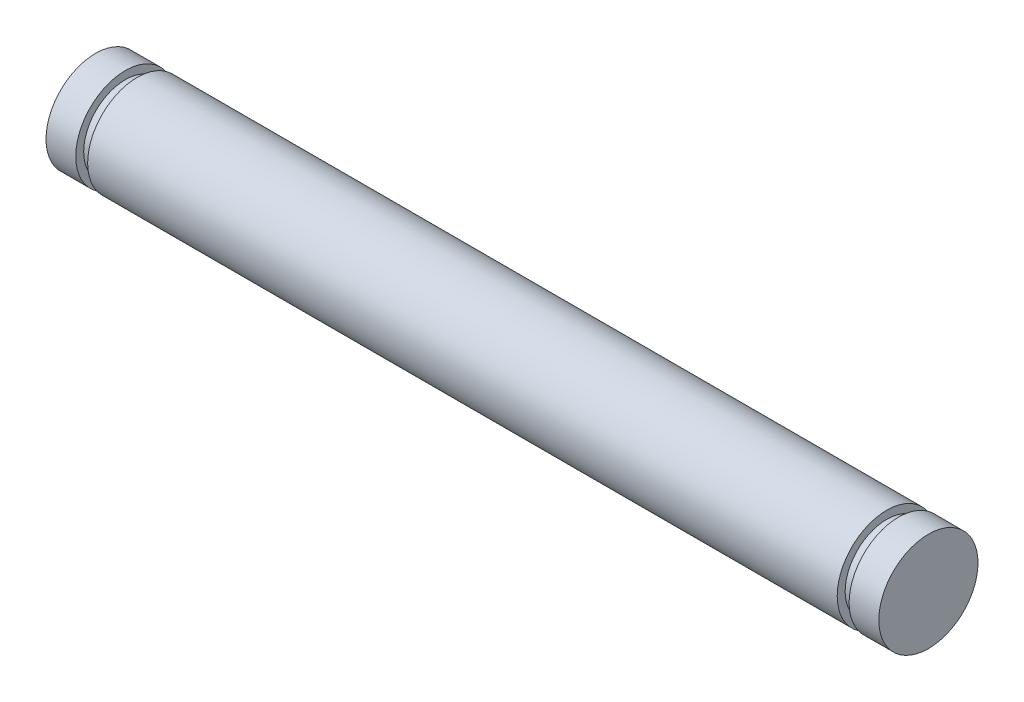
ISO-10303-21;
HEADER;
FILE_DESCRIPTION(('STEP AP214'),'2;1');
FILE_NAME('part.step','',(''),(''),'','','');
FILE_SCHEMA(('AUTOMOTIVE_DESIGN { 1 0 10303 214 1 1 1 1 }'));
ENDSEC;
DATA;
#1=APPLICATION_CONTEXT('core data for automotive mechanical design processes');
#2=APPLICATION_PROTOCOL_DEFINITION('international standard','automotive_design',2000,#1);
#3=PRODUCT_CONTEXT('',#1,'mechanical');
#4=PRODUCT('Part','Part','',(#3));
#5=PRODUCT_RELATED_PRODUCT_CATEGORY('part','',(#4));
#6=PRODUCT_DEFINITION_FORMATION('','',#4);
#7=PRODUCT_DEFINITION_CONTEXT('part definition',#1,'design');
#8=PRODUCT_DEFINITION('design','',#6,#7);
#9=PRODUCT_DEFINITION_SHAPE('','',#8);
#10=(LENGTH_UNIT() NAMED_UNIT(*) SI_UNIT(.MILLI.,.METRE.));
#11=(NAMED_UNIT(*) PLANE_ANGLE_UNIT() SI_UNIT($,.RADIAN.));
#12=(NAMED_UNIT(*) SI_UNIT($,.STERADIAN.) SOLID_ANGLE_UNIT());
#13=UNCERTAINTY_MEASURE_WITH_UNIT(LENGTH_MEASURE(1.E-05),#10,'distance_accuracy_value','');
#14=(GEOMETRIC_REPRESENTATION_CONTEXT(3) GLOBAL_UNCERTAINTY_ASSIGNED_CONTEXT((#13)) GLOBAL_UNIT_ASSIGNED_CONTEXT((#10,
#11,#12)) REPRESENTATION_CONTEXT('',''));
#15=CARTESIAN_POINT('',(0.,0.,0.));
#16=DIRECTION('',(0.,0.,1.));
#17=DIRECTION('',(1.,0.,0.));
#18=AXIS2_PLACEMENT_3D('',#15,#16,#17);
#19=CARTESIAN_POINT('',(26.67,0.,0.));
#20=DIRECTION('',(-1.,0.,0.));
#21=DIRECTION('',(0.,0.,1.));
#22=AXIS2_PLACEMENT_3D('',#19,#20,#21);
#23=CYLINDRICAL_SURFACE('',#22,3.175);
#24=CARTESIAN_POINT('',(-26.67,0.,0.));
#25=DIRECTION('',(1.,0.,0.));
#26=DIRECTION('',(0.,0.,-1.));
#27=AXIS2_PLACEMENT_3D('',#24,#25,#26);
#28=CIRCLE('',#27,3.175);
#29=CARTESIAN_POINT('',(-26.67,0.,-3.175));
#30=VERTEX_POINT('',#29);
#31=EDGE_CURVE('E38',#30,#30,#28,.T.);
#32=ORIENTED_EDGE('',*,*,#31,.T.);
#33=EDGE_LOOP('',(#32));
#34=FACE_BOUND('',#33,.T.);
#35=CARTESIAN_POINT('',(-24.765,0.,0.));
#36=DIRECTION('',(-1.,0.,0.));
#37=DIRECTION('',(0.,0.,1.));
#38=AXIS2_PLACEMENT_3D('',#35,#36,#37);
#39=CIRCLE('',#38,3.175);
#40=CARTESIAN_POINT('',(-24.765,0.,3.175));
#41=VERTEX_POINT('',#40);
#42=EDGE_CURVE('E45',#41,#41,#39,.T.);
#43=ORIENTED_EDGE('',*,*,#42,.T.);
#44=EDGE_LOOP('',(#43));
#45=FACE_BOUND('',#44,.T.);
#46=ADVANCED_FACE('F35',(#34,#45),#23,.T.);
#47=CARTESIAN_POINT('',(-26.67,0.,0.));
#48=DIRECTION('',(1.,0.,0.));
#49=DIRECTION('',(0.,0.,-1.));
#50=AXIS2_PLACEMENT_3D('',#47,#48,#49);
#51=PLANE('',#50);
#52=ORIENTED_EDGE('',*,*,#31,.F.);
#53=EDGE_LOOP('',(#52));
#54=FACE_BOUND('',#53,.T.);
#55=ADVANCED_FACE('F92',(#54),#51,.F.);
#56=CARTESIAN_POINT('',(-24.765,3.175,0.));
#57=DIRECTION('',(1.,0.,0.));
#58=DIRECTION('',(0.,0.,-1.));
#59=AXIS2_PLACEMENT_3D('',#56,#57,#58);
#60=PLANE('',#59);
#61=CARTESIAN_POINT('',(-24.765,0.,0.));
#62=DIRECTION('',(-1.,0.,0.));
#63=DIRECTION('',(0.,0.,1.));
#64=AXIS2_PLACEMENT_3D('',#61,#62,#63);
#65=CIRCLE('',#64,2.667);
#66=CARTESIAN_POINT('',(-24.765,0.,2.667));
#67=VERTEX_POINT('',#66);
#68=EDGE_CURVE('E62',#67,#67,#65,.T.);
#69=ORIENTED_EDGE('',*,*,#68,.T.);
#70=EDGE_LOOP('',(#69));
#71=FACE_BOUND('',#70,.T.);
#72=ORIENTED_EDGE('',*,*,#42,.F.);
#73=EDGE_LOOP('',(#72));
#74=FACE_BOUND('',#73,.T.);
#75=ADVANCED_FACE('F97',(#71,#74),#60,.T.);
#76=CARTESIAN_POINT('',(-26.67,0.,0.));
#77=DIRECTION('',(-1.,0.,0.));
#78=DIRECTION('',(0.,0.,1.));
#79=AXIS2_PLACEMENT_3D('',#76,#77,#78);
#80=CYLINDRICAL_SURFACE('',#79,2.667);
#81=CARTESIAN_POINT('',(-24.003,0.,0.));
#82=DIRECTION('',(-1.,0.,0.));
#83=DIRECTION('',(0.,0.,1.));
#84=AXIS2_PLACEMENT_3D('',#81,#82,#83);
#85=CIRCLE('',#84,2.667);
#86=CARTESIAN_POINT('',(-24.003,0.,2.667));
#87=VERTEX_POINT('',#86);
#88=EDGE_CURVE('E65',#87,#87,#85,.T.);
#89=ORIENTED_EDGE('',*,*,#88,.T.);
#90=EDGE_LOOP('',(#89));
#91=FACE_BOUND('',#90,.T.);
#92=ORIENTED_EDGE('',*,*,#68,.F.);
#93=EDGE_LOOP('',(#92));
#94=FACE_BOUND('',#93,.T.);
#95=ADVANCED_FACE('F86',(#91,#94),#80,.T.);
#96=CARTESIAN_POINT('',(-24.003,2.667,0.));
#97=DIRECTION('',(-1.,0.,0.));
#98=DIRECTION('',(0.,0.,1.));
#99=AXIS2_PLACEMENT_3D('',#96,#97,#98);
#100=PLANE('',#99);
#101=CARTESIAN_POINT('',(-24.003,0.,0.));
#102=DIRECTION('',(-1.,0.,0.));
#103=DIRECTION('',(0.,0.,1.));
#104=AXIS2_PLACEMENT_3D('',#101,#102,#103);
#105=CIRCLE('',#104,3.175);
#106=CARTESIAN_POINT('',(-24.003,0.,3.175));
#107=VERTEX_POINT('',#106);
#108=EDGE_CURVE('E50',#107,#107,#105,.T.);
#109=ORIENTED_EDGE('',*,*,#108,.T.);
#110=EDGE_LOOP('',(#109));
#111=FACE_BOUND('',#110,.T.);
#112=ORIENTED_EDGE('',*,*,#88,.F.);
#113=EDGE_LOOP('',(#112));
#114=FACE_BOUND('',#113,.T.);
#115=ADVANCED_FACE('F71',(#111,#114),#100,.T.);
#116=CARTESIAN_POINT('',(24.003,0.,0.));
#117=DIRECTION('',(-1.,0.,0.));
#118=DIRECTION('',(0.,0.,1.));
#119=AXIS2_PLACEMENT_3D('',#116,#117,#118);
#120=CIRCLE('',#119,3.175);
#121=CARTESIAN_POINT('',(24.003,0.,3.175));
#122=VERTEX_POINT('',#121);
#123=EDGE_CURVE('E47',#122,#122,#120,.T.);
#124=ORIENTED_EDGE('',*,*,#123,.T.);
#125=EDGE_LOOP('',(#124));
#126=FACE_BOUND('',#125,.T.);
#127=ORIENTED_EDGE('',*,*,#108,.F.);
#128=EDGE_LOOP('',(#127));
#129=FACE_BOUND('',#128,.T.);
#130=ADVANCED_FACE('F74',(#126,#129),#23,.T.);
#131=CARTESIAN_POINT('',(24.003,2.667,0.));
#132=DIRECTION('',(1.,0.,0.));
#133=DIRECTION('',(0.,0.,-1.));
#134=AXIS2_PLACEMENT_3D('',#131,#132,#133);
#135=PLANE('',#134);
#136=CARTESIAN_POINT('',(24.003,0.,0.));
#137=DIRECTION('',(-1.,0.,0.));
#138=DIRECTION('',(0.,0.,1.));
#139=AXIS2_PLACEMENT_3D('',#136,#137,#138);
#140=CIRCLE('',#139,2.667);
#141=CARTESIAN_POINT('',(24.003,0.,2.667));
#142=VERTEX_POINT('',#141);
#143=EDGE_CURVE('E57',#142,#142,#140,.T.);
#144=ORIENTED_EDGE('',*,*,#143,.T.);
#145=EDGE_LOOP('',(#144));
#146=FACE_BOUND('',#145,.T.);
#147=ORIENTED_EDGE('',*,*,#123,.F.);
#148=EDGE_LOOP('',(#147));
#149=FACE_BOUND('',#148,.T.);
#150=ADVANCED_FACE('F76',(#146,#149),#135,.T.);
#151=CARTESIAN_POINT('',(24.765,3.175,0.));
#152=DIRECTION('',(-1.,0.,0.));
#153=DIRECTION('',(0.,0.,1.));
#154=AXIS2_PLACEMENT_3D('',#151,#152,#153);
#155=PLANE('',#154);
#156=CARTESIAN_POINT('',(24.765,0.,0.));
#157=DIRECTION('',(-1.,0.,0.));
#158=DIRECTION('',(0.,0.,1.));
#159=AXIS2_PLACEMENT_3D('',#156,#157,#158);
#160=CIRCLE('',#159,3.175);
#161=CARTESIAN_POINT('',(24.765,0.,3.175));
#162=VERTEX_POINT('',#161);
#163=EDGE_CURVE('E51',#162,#162,#160,.T.);
#164=ORIENTED_EDGE('',*,*,#163,.T.);
#165=EDGE_LOOP('',(#164));
#166=FACE_BOUND('',#165,.T.);
#167=CARTESIAN_POINT('',(24.765,0.,0.));
#168=DIRECTION('',(-1.,0.,0.));
#169=DIRECTION('',(0.,0.,1.));
#170=AXIS2_PLACEMENT_3D('',#167,#168,#169);
#171=CIRCLE('',#170,2.667);
#172=CARTESIAN_POINT('',(24.765,0.,2.667));
#173=VERTEX_POINT('',#172);
#174=EDGE_CURVE('E54',#173,#173,#171,.T.);
#175=ORIENTED_EDGE('',*,*,#174,.F.);
#176=EDGE_LOOP('',(#175));
#177=FACE_BOUND('',#176,.T.);
#178=ADVANCED_FACE('F83',(#166,#177),#155,.T.);
#179=CARTESIAN_POINT('',(-26.67,0.,0.));
#180=DIRECTION('',(-1.,0.,0.));
#181=DIRECTION('',(0.,0.,1.));
#182=AXIS2_PLACEMENT_3D('',#179,#180,#181);
#183=CYLINDRICAL_SURFACE('',#182,2.667);
#184=ORIENTED_EDGE('',*,*,#174,.T.);
#185=EDGE_LOOP('',(#184));
#186=FACE_BOUND('',#185,.T.);
#187=ORIENTED_EDGE('',*,*,#143,.F.);
#188=EDGE_LOOP('',(#187));
#189=FACE_BOUND('',#188,.T.);
#190=ADVANCED_FACE('F112',(#186,#189),#183,.T.);
#191=CARTESIAN_POINT('',(26.67,0.,0.));
#192=DIRECTION('',(1.,0.,0.));
#193=DIRECTION('',(0.,0.,-1.));
#194=AXIS2_PLACEMENT_3D('',#191,#192,#193);
#195=PLANE('',#194);
#196=CARTESIAN_POINT('',(26.67,0.,0.));
#197=DIRECTION('',(1.,0.,0.));
#198=DIRECTION('',(0.,0.,-1.));
#199=AXIS2_PLACEMENT_3D('',#196,#197,#198);
#200=CIRCLE('',#199,3.175);
#201=CARTESIAN_POINT('',(26.67,0.,-3.175));
#202=VERTEX_POINT('',#201);
#203=EDGE_CURVE('E10',#202,#202,#200,.T.);
#204=ORIENTED_EDGE('',*,*,#203,.T.);
#205=EDGE_LOOP('',(#204));
#206=FACE_BOUND('',#205,.T.);
#207=ADVANCED_FACE('F89',(#206),#195,.T.);
#208=ORIENTED_EDGE('',*,*,#203,.F.);
#209=EDGE_LOOP('',(#208));
#210=FACE_BOUND('',#209,.T.);
#211=ORIENTED_EDGE('',*,*,#163,.F.);
#212=EDGE_LOOP('',(#211));
#213=FACE_BOUND('',#212,.T.);
#214=ADVANCED_FACE('F78',(#210,#213),#23,.T.);
#215=CLOSED_SHELL('',(#46,#55,#75,#95,#115,#130,#150,#178,#190,#207,#214));
#216=MANIFOLD_SOLID_BREP('B2',#215);
#217=ADVANCED_BREP_SHAPE_REPRESENTATION('',(#18,#216),#14);
#218=SHAPE_DEFINITION_REPRESENTATION(#9,#217);
ENDSEC;
END-ISO-10303-21;
